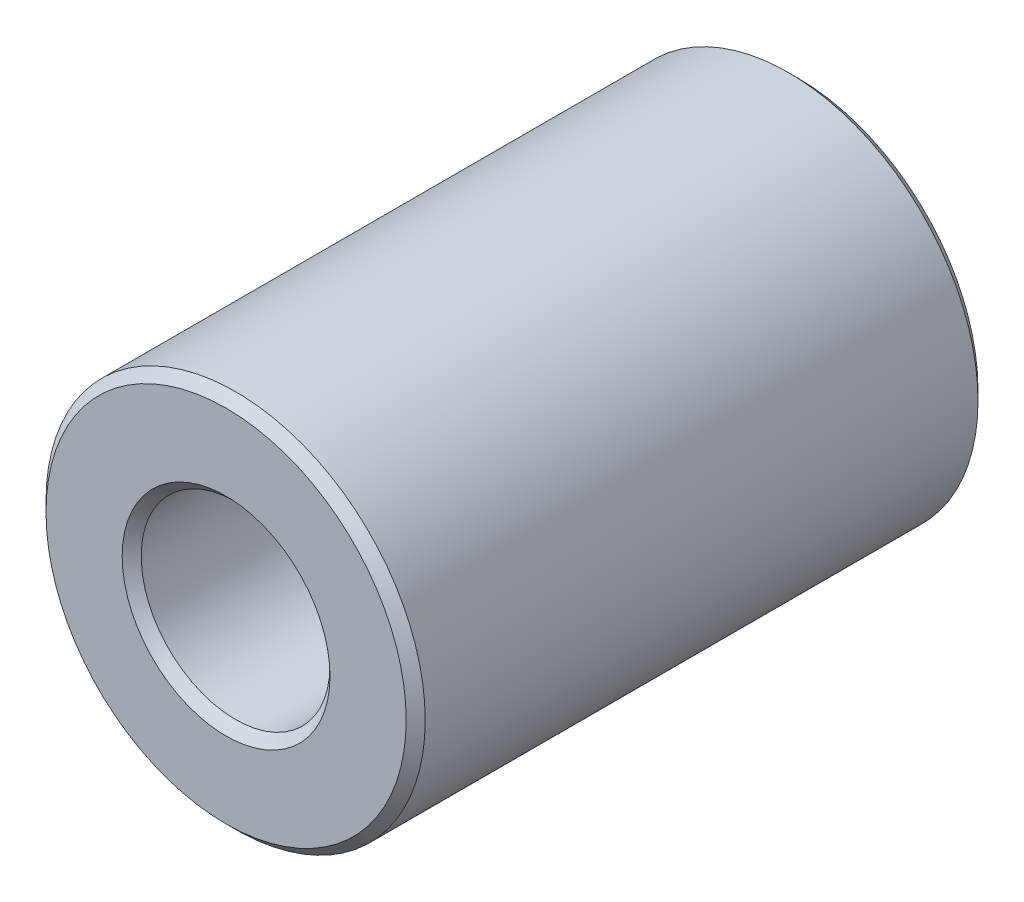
from build123d import *

# Parameters (mm, degrees)
BOSS_EXTRUDE1_DEPTH      = 7.54
BOSS_EXTRUDE1_DEPTH_BACK = 7.54
SKETCH3_R                = 5
SKETCH3_R_2              = 2.4892
CHAMFER1_SIZE            = 0.25108


with BuildPart() as part:
    # Sketch3 → Boss-Extrude1 (new, two sides: drawn at the far end of the back side and taken through both)
    with BuildSketch(Plane.XY.offset(-BOSS_EXTRUDE1_DEPTH_BACK)):
        Circle(SKETCH3_R)
        Circle(SKETCH3_R_2, mode=Mode.SUBTRACT)
    extrude(amount=BOSS_EXTRUDE1_DEPTH + BOSS_EXTRUDE1_DEPTH_BACK)

    # Chamfer1
    chamfer1_edges = [part.edges().sort_by_distance(p)[0] for p in [
        (-5, 0, -7.54),
        (-2.4892, 0, -7.54),
        (-5, 0, 7.54),
        (-2.4892, 0, 7.54),
    ]]
    chamfer(chamfer1_edges, length=CHAMFER1_SIZE)


solid = part.part
